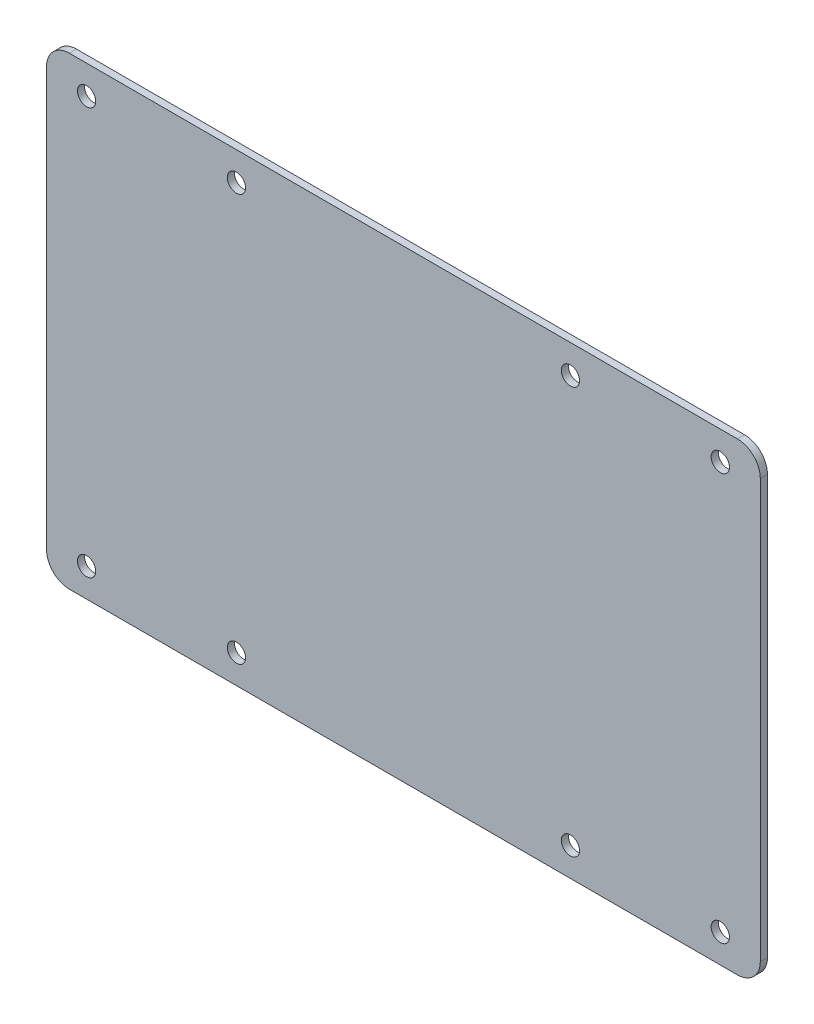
ISO-10303-21;
HEADER;
FILE_DESCRIPTION(('STEP AP214'),'2;1');
FILE_NAME('part.step','',(''),(''),'','','');
FILE_SCHEMA(('AUTOMOTIVE_DESIGN { 1 0 10303 214 1 1 1 1 }'));
ENDSEC;
DATA;
#1=APPLICATION_CONTEXT('core data for automotive mechanical design processes');
#2=APPLICATION_PROTOCOL_DEFINITION('international standard','automotive_design',2000,#1);
#3=PRODUCT_CONTEXT('',#1,'mechanical');
#4=PRODUCT('Part','Part','',(#3));
#5=PRODUCT_RELATED_PRODUCT_CATEGORY('part','',(#4));
#6=PRODUCT_DEFINITION_FORMATION('','',#4);
#7=PRODUCT_DEFINITION_CONTEXT('part definition',#1,'design');
#8=PRODUCT_DEFINITION('design','',#6,#7);
#9=PRODUCT_DEFINITION_SHAPE('','',#8);
#10=(LENGTH_UNIT() NAMED_UNIT(*) SI_UNIT(.MILLI.,.METRE.));
#11=(NAMED_UNIT(*) PLANE_ANGLE_UNIT() SI_UNIT($,.RADIAN.));
#12=(NAMED_UNIT(*) SI_UNIT($,.STERADIAN.) SOLID_ANGLE_UNIT());
#13=UNCERTAINTY_MEASURE_WITH_UNIT(LENGTH_MEASURE(1.E-05),#10,'distance_accuracy_value','');
#14=(GEOMETRIC_REPRESENTATION_CONTEXT(3) GLOBAL_UNCERTAINTY_ASSIGNED_CONTEXT((#13)) GLOBAL_UNIT_ASSIGNED_CONTEXT((#10,
#11,#12)) REPRESENTATION_CONTEXT('',''));
#15=CARTESIAN_POINT('',(0.,0.,0.));
#16=DIRECTION('',(0.,0.,1.));
#17=DIRECTION('',(1.,0.,0.));
#18=AXIS2_PLACEMENT_3D('',#15,#16,#17);
#19=CARTESIAN_POINT('',(3.81,78.97,1.5875));
#20=DIRECTION('',(0.,0.,-1.));
#21=DIRECTION('',(-1.,0.,0.));
#22=AXIS2_PLACEMENT_3D('',#19,#20,#21);
#23=PLANE('',#22);
#24=CARTESIAN_POINT('',(40.905,77.7,1.5875));
#25=DIRECTION('',(0.,0.,1.));
#26=DIRECTION('',(1.,0.,0.));
#27=AXIS2_PLACEMENT_3D('',#24,#25,#26);
#28=CIRCLE('',#27,2.03200000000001);
#29=CARTESIAN_POINT('',(42.937,77.7,1.5875));
#30=VERTEX_POINT('',#29);
#31=EDGE_CURVE('E212',#30,#30,#28,.T.);
#32=ORIENTED_EDGE('',*,*,#31,.F.);
#33=EDGE_LOOP('',(#32));
#34=FACE_BOUND('',#33,.T.);
#35=CARTESIAN_POINT('',(148.38,77.7,1.5875));
#36=DIRECTION('',(0.,0.,1.));
#37=DIRECTION('',(1.,0.,0.));
#38=AXIS2_PLACEMENT_3D('',#35,#36,#37);
#39=CIRCLE('',#38,2.03200000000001);
#40=CARTESIAN_POINT('',(150.412,77.7,1.5875));
#41=VERTEX_POINT('',#40);
#42=EDGE_CURVE('E200',#41,#41,#39,.T.);
#43=ORIENTED_EDGE('',*,*,#42,.F.);
#44=EDGE_LOOP('',(#43));
#45=FACE_BOUND('',#44,.T.);
#46=CARTESIAN_POINT('',(115.095,-12.7,1.5875));
#47=DIRECTION('',(0.,0.,1.));
#48=DIRECTION('',(1.,0.,0.));
#49=AXIS2_PLACEMENT_3D('',#46,#47,#48);
#50=CIRCLE('',#49,2.03200000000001);
#51=CARTESIAN_POINT('',(117.127,-12.7,1.5875));
#52=VERTEX_POINT('',#51);
#53=EDGE_CURVE('E188',#52,#52,#50,.T.);
#54=ORIENTED_EDGE('',*,*,#53,.F.);
#55=EDGE_LOOP('',(#54));
#56=FACE_BOUND('',#55,.T.);
#57=CARTESIAN_POINT('',(40.905,-12.7,1.5875));
#58=DIRECTION('',(0.,0.,1.));
#59=DIRECTION('',(1.,0.,0.));
#60=AXIS2_PLACEMENT_3D('',#57,#58,#59);
#61=CIRCLE('',#60,2.03200000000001);
#62=CARTESIAN_POINT('',(42.937,-12.7,1.5875));
#63=VERTEX_POINT('',#62);
#64=EDGE_CURVE('E134',#63,#63,#61,.T.);
#65=ORIENTED_EDGE('',*,*,#64,.F.);
#66=EDGE_LOOP('',(#65));
#67=FACE_BOUND('',#66,.T.);
#68=CARTESIAN_POINT('',(3.81,78.97,1.5875));
#69=DIRECTION('',(0.,0.,1.));
#70=DIRECTION('',(-1.,0.,0.));
#71=AXIS2_PLACEMENT_3D('',#68,#69,#70);
#72=CIRCLE('',#71,5.08);
#73=CARTESIAN_POINT('',(3.80999999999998,84.05,1.5875));
#74=VERTEX_POINT('',#73);
#75=CARTESIAN_POINT('',(-1.27,78.97,1.5875));
#76=VERTEX_POINT('',#75);
#77=EDGE_CURVE('E145',#74,#76,#72,.T.);
#78=ORIENTED_EDGE('',*,*,#77,.T.);
#79=DIRECTION('',(0.,-1.,0.));
#80=VECTOR('',#79,1.);
#81=CARTESIAN_POINT('',(-1.27,78.97,1.5875));
#82=LINE('',#81,#80);
#83=CARTESIAN_POINT('',(-1.27,-13.97,1.5875));
#84=VERTEX_POINT('',#83);
#85=EDGE_CURVE('E93',#76,#84,#82,.T.);
#86=ORIENTED_EDGE('',*,*,#85,.T.);
#87=CARTESIAN_POINT('',(3.81000000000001,-13.97,1.5875));
#88=DIRECTION('',(0.,0.,1.));
#89=DIRECTION('',(1.,0.,0.));
#90=AXIS2_PLACEMENT_3D('',#87,#88,#89);
#91=CIRCLE('',#90,5.08000000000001);
#92=CARTESIAN_POINT('',(3.81,-19.05,1.5875));
#93=VERTEX_POINT('',#92);
#94=EDGE_CURVE('E160',#84,#93,#91,.T.);
#95=ORIENTED_EDGE('',*,*,#94,.T.);
#96=DIRECTION('',(1.,0.,0.));
#97=VECTOR('',#96,1.);
#98=CARTESIAN_POINT('',(3.81,-19.05,1.5875));
#99=LINE('',#98,#97);
#100=CARTESIAN_POINT('',(152.19,-19.05,1.5875));
#101=VERTEX_POINT('',#100);
#102=EDGE_CURVE('E173',#93,#101,#99,.T.);
#103=ORIENTED_EDGE('',*,*,#102,.T.);
#104=CARTESIAN_POINT('',(152.19,-13.97,1.5875));
#105=DIRECTION('',(0.,0.,1.));
#106=DIRECTION('',(-1.,0.,0.));
#107=AXIS2_PLACEMENT_3D('',#104,#105,#106);
#108=CIRCLE('',#107,5.08);
#109=CARTESIAN_POINT('',(157.27,-13.97,1.5875));
#110=VERTEX_POINT('',#109);
#111=EDGE_CURVE('E112',#101,#110,#108,.T.);
#112=ORIENTED_EDGE('',*,*,#111,.T.);
#113=DIRECTION('',(0.,1.,0.));
#114=VECTOR('',#113,1.);
#115=CARTESIAN_POINT('',(157.27,-13.97,1.5875));
#116=LINE('',#115,#114);
#117=CARTESIAN_POINT('',(157.27,78.97,1.5875));
#118=VERTEX_POINT('',#117);
#119=EDGE_CURVE('E106',#110,#118,#116,.T.);
#120=ORIENTED_EDGE('',*,*,#119,.T.);
#121=CARTESIAN_POINT('',(152.19,78.97,1.5875));
#122=DIRECTION('',(0.,0.,1.));
#123=DIRECTION('',(-1.,0.,0.));
#124=AXIS2_PLACEMENT_3D('',#121,#122,#123);
#125=CIRCLE('',#124,5.08);
#126=CARTESIAN_POINT('',(152.19,84.05,1.5875));
#127=VERTEX_POINT('',#126);
#128=EDGE_CURVE('E110',#118,#127,#125,.T.);
#129=ORIENTED_EDGE('',*,*,#128,.T.);
#130=DIRECTION('',(-1.,0.,0.));
#131=VECTOR('',#130,1.);
#132=CARTESIAN_POINT('',(3.80999999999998,84.05,1.5875));
#133=LINE('',#132,#131);
#134=EDGE_CURVE('E50',#127,#74,#133,.T.);
#135=ORIENTED_EDGE('',*,*,#134,.T.);
#136=EDGE_LOOP('',(#78,#86,#95,#103,#112,#120,#129,#135));
#137=FACE_BOUND('',#136,.T.);
#138=CARTESIAN_POINT('',(7.62,-12.7,1.5875));
#139=DIRECTION('',(0.,0.,1.));
#140=DIRECTION('',(1.,0.,0.));
#141=AXIS2_PLACEMENT_3D('',#138,#139,#140);
#142=CIRCLE('',#141,2.03200000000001);
#143=CARTESIAN_POINT('',(9.652,-12.7,1.5875));
#144=VERTEX_POINT('',#143);
#145=EDGE_CURVE('E182',#144,#144,#142,.T.);
#146=ORIENTED_EDGE('',*,*,#145,.F.);
#147=EDGE_LOOP('',(#146));
#148=FACE_BOUND('',#147,.T.);
#149=CARTESIAN_POINT('',(148.38,-12.7,1.5875));
#150=DIRECTION('',(0.,0.,1.));
#151=DIRECTION('',(1.,0.,0.));
#152=AXIS2_PLACEMENT_3D('',#149,#150,#151);
#153=CIRCLE('',#152,2.03200000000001);
#154=CARTESIAN_POINT('',(150.412,-12.7,1.5875));
#155=VERTEX_POINT('',#154);
#156=EDGE_CURVE('E194',#155,#155,#153,.T.);
#157=ORIENTED_EDGE('',*,*,#156,.F.);
#158=EDGE_LOOP('',(#157));
#159=FACE_BOUND('',#158,.T.);
#160=CARTESIAN_POINT('',(115.095,77.7,1.5875));
#161=DIRECTION('',(0.,0.,1.));
#162=DIRECTION('',(1.,0.,0.));
#163=AXIS2_PLACEMENT_3D('',#160,#161,#162);
#164=CIRCLE('',#163,2.03200000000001);
#165=CARTESIAN_POINT('',(117.127,77.7,1.5875));
#166=VERTEX_POINT('',#165);
#167=EDGE_CURVE('E206',#166,#166,#164,.T.);
#168=ORIENTED_EDGE('',*,*,#167,.F.);
#169=EDGE_LOOP('',(#168));
#170=FACE_BOUND('',#169,.T.);
#171=CARTESIAN_POINT('',(7.62,77.7,1.5875));
#172=DIRECTION('',(0.,0.,1.));
#173=DIRECTION('',(1.,0.,0.));
#174=AXIS2_PLACEMENT_3D('',#171,#172,#173);
#175=CIRCLE('',#174,2.03200000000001);
#176=CARTESIAN_POINT('',(9.652,77.7,1.5875));
#177=VERTEX_POINT('',#176);
#178=EDGE_CURVE('E218',#177,#177,#175,.T.);
#179=ORIENTED_EDGE('',*,*,#178,.F.);
#180=EDGE_LOOP('',(#179));
#181=FACE_BOUND('',#180,.T.);
#182=ADVANCED_FACE('F33',(#34,#45,#56,#67,#137,#148,#159,#170,#181),#23,.F.);
#183=CARTESIAN_POINT('',(3.81,78.97,0.));
#184=DIRECTION('',(0.,0.,-1.));
#185=DIRECTION('',(-1.,0.,0.));
#186=AXIS2_PLACEMENT_3D('',#183,#184,#185);
#187=PLANE('',#186);
#188=CARTESIAN_POINT('',(40.905,77.7,0.));
#189=DIRECTION('',(0.,0.,1.));
#190=DIRECTION('',(1.,0.,0.));
#191=AXIS2_PLACEMENT_3D('',#188,#189,#190);
#192=CIRCLE('',#191,2.03200000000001);
#193=CARTESIAN_POINT('',(42.937,77.7,0.));
#194=VERTEX_POINT('',#193);
#195=EDGE_CURVE('E215',#194,#194,#192,.T.);
#196=ORIENTED_EDGE('',*,*,#195,.T.);
#197=EDGE_LOOP('',(#196));
#198=FACE_BOUND('',#197,.T.);
#199=CARTESIAN_POINT('',(148.38,77.7,0.));
#200=DIRECTION('',(0.,0.,1.));
#201=DIRECTION('',(1.,0.,0.));
#202=AXIS2_PLACEMENT_3D('',#199,#200,#201);
#203=CIRCLE('',#202,2.03200000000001);
#204=CARTESIAN_POINT('',(150.412,77.7,0.));
#205=VERTEX_POINT('',#204);
#206=EDGE_CURVE('E203',#205,#205,#203,.T.);
#207=ORIENTED_EDGE('',*,*,#206,.T.);
#208=EDGE_LOOP('',(#207));
#209=FACE_BOUND('',#208,.T.);
#210=CARTESIAN_POINT('',(115.095,-12.7,0.));
#211=DIRECTION('',(0.,0.,1.));
#212=DIRECTION('',(1.,0.,0.));
#213=AXIS2_PLACEMENT_3D('',#210,#211,#212);
#214=CIRCLE('',#213,2.03200000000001);
#215=CARTESIAN_POINT('',(117.127,-12.7,0.));
#216=VERTEX_POINT('',#215);
#217=EDGE_CURVE('E191',#216,#216,#214,.T.);
#218=ORIENTED_EDGE('',*,*,#217,.T.);
#219=EDGE_LOOP('',(#218));
#220=FACE_BOUND('',#219,.T.);
#221=CARTESIAN_POINT('',(40.905,-12.7,0.));
#222=DIRECTION('',(0.,0.,1.));
#223=DIRECTION('',(1.,0.,0.));
#224=AXIS2_PLACEMENT_3D('',#221,#222,#223);
#225=CIRCLE('',#224,2.03200000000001);
#226=CARTESIAN_POINT('',(42.937,-12.7,0.));
#227=VERTEX_POINT('',#226);
#228=EDGE_CURVE('E179',#227,#227,#225,.T.);
#229=ORIENTED_EDGE('',*,*,#228,.T.);
#230=EDGE_LOOP('',(#229));
#231=FACE_BOUND('',#230,.T.);
#232=CARTESIAN_POINT('',(3.81,78.97,0.));
#233=DIRECTION('',(0.,0.,1.));
#234=DIRECTION('',(-1.,0.,0.));
#235=AXIS2_PLACEMENT_3D('',#232,#233,#234);
#236=CIRCLE('',#235,5.08);
#237=CARTESIAN_POINT('',(3.80999999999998,84.05,0.));
#238=VERTEX_POINT('',#237);
#239=CARTESIAN_POINT('',(-1.27,78.97,0.));
#240=VERTEX_POINT('',#239);
#241=EDGE_CURVE('E130',#238,#240,#236,.T.);
#242=ORIENTED_EDGE('',*,*,#241,.F.);
#243=DIRECTION('',(-1.,0.,0.));
#244=VECTOR('',#243,1.);
#245=CARTESIAN_POINT('',(3.80999999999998,84.05,0.));
#246=LINE('',#245,#244);
#247=CARTESIAN_POINT('',(152.19,84.05,0.));
#248=VERTEX_POINT('',#247);
#249=EDGE_CURVE('E85',#248,#238,#246,.T.);
#250=ORIENTED_EDGE('',*,*,#249,.F.);
#251=CARTESIAN_POINT('',(152.19,78.97,0.));
#252=DIRECTION('',(0.,0.,1.));
#253=DIRECTION('',(-1.,0.,0.));
#254=AXIS2_PLACEMENT_3D('',#251,#252,#253);
#255=CIRCLE('',#254,5.08);
#256=CARTESIAN_POINT('',(157.27,78.97,0.));
#257=VERTEX_POINT('',#256);
#258=EDGE_CURVE('E79',#257,#248,#255,.T.);
#259=ORIENTED_EDGE('',*,*,#258,.F.);
#260=DIRECTION('',(0.,1.,0.));
#261=VECTOR('',#260,1.);
#262=CARTESIAN_POINT('',(157.27,-13.97,0.));
#263=LINE('',#262,#261);
#264=CARTESIAN_POINT('',(157.27,-13.97,0.));
#265=VERTEX_POINT('',#264);
#266=EDGE_CURVE('E120',#265,#257,#263,.T.);
#267=ORIENTED_EDGE('',*,*,#266,.F.);
#268=CARTESIAN_POINT('',(152.19,-13.97,0.));
#269=DIRECTION('',(0.,0.,1.));
#270=DIRECTION('',(-1.,0.,0.));
#271=AXIS2_PLACEMENT_3D('',#268,#269,#270);
#272=CIRCLE('',#271,5.08);
#273=CARTESIAN_POINT('',(152.19,-19.05,0.));
#274=VERTEX_POINT('',#273);
#275=EDGE_CURVE('E140',#274,#265,#272,.T.);
#276=ORIENTED_EDGE('',*,*,#275,.F.);
#277=DIRECTION('',(1.,0.,0.));
#278=VECTOR('',#277,1.);
#279=CARTESIAN_POINT('',(3.81,-19.05,0.));
#280=LINE('',#279,#278);
#281=CARTESIAN_POINT('',(3.81,-19.05,0.));
#282=VERTEX_POINT('',#281);
#283=EDGE_CURVE('E138',#282,#274,#280,.T.);
#284=ORIENTED_EDGE('',*,*,#283,.F.);
#285=CARTESIAN_POINT('',(3.81000000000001,-13.97,0.));
#286=DIRECTION('',(0.,0.,1.));
#287=DIRECTION('',(1.,0.,0.));
#288=AXIS2_PLACEMENT_3D('',#285,#286,#287);
#289=CIRCLE('',#288,5.08000000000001);
#290=CARTESIAN_POINT('',(-1.27,-13.97,0.));
#291=VERTEX_POINT('',#290);
#292=EDGE_CURVE('E136',#291,#282,#289,.T.);
#293=ORIENTED_EDGE('',*,*,#292,.F.);
#294=DIRECTION('',(0.,-1.,0.));
#295=VECTOR('',#294,1.);
#296=CARTESIAN_POINT('',(-1.27,78.97,0.));
#297=LINE('',#296,#295);
#298=EDGE_CURVE('E133',#240,#291,#297,.T.);
#299=ORIENTED_EDGE('',*,*,#298,.F.);
#300=EDGE_LOOP('',(#242,#250,#259,#267,#276,#284,#293,#299));
#301=FACE_BOUND('',#300,.T.);
#302=CARTESIAN_POINT('',(7.62,-12.7,0.));
#303=DIRECTION('',(0.,0.,1.));
#304=DIRECTION('',(1.,0.,0.));
#305=AXIS2_PLACEMENT_3D('',#302,#303,#304);
#306=CIRCLE('',#305,2.03200000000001);
#307=CARTESIAN_POINT('',(9.652,-12.7,0.));
#308=VERTEX_POINT('',#307);
#309=EDGE_CURVE('E185',#308,#308,#306,.T.);
#310=ORIENTED_EDGE('',*,*,#309,.T.);
#311=EDGE_LOOP('',(#310));
#312=FACE_BOUND('',#311,.T.);
#313=CARTESIAN_POINT('',(148.38,-12.7,0.));
#314=DIRECTION('',(0.,0.,1.));
#315=DIRECTION('',(1.,0.,0.));
#316=AXIS2_PLACEMENT_3D('',#313,#314,#315);
#317=CIRCLE('',#316,2.03200000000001);
#318=CARTESIAN_POINT('',(150.412,-12.7,0.));
#319=VERTEX_POINT('',#318);
#320=EDGE_CURVE('E197',#319,#319,#317,.T.);
#321=ORIENTED_EDGE('',*,*,#320,.T.);
#322=EDGE_LOOP('',(#321));
#323=FACE_BOUND('',#322,.T.);
#324=CARTESIAN_POINT('',(115.095,77.7,0.));
#325=DIRECTION('',(0.,0.,1.));
#326=DIRECTION('',(1.,0.,0.));
#327=AXIS2_PLACEMENT_3D('',#324,#325,#326);
#328=CIRCLE('',#327,2.03200000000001);
#329=CARTESIAN_POINT('',(117.127,77.7,0.));
#330=VERTEX_POINT('',#329);
#331=EDGE_CURVE('E209',#330,#330,#328,.T.);
#332=ORIENTED_EDGE('',*,*,#331,.T.);
#333=EDGE_LOOP('',(#332));
#334=FACE_BOUND('',#333,.T.);
#335=CARTESIAN_POINT('',(7.62,77.7,0.));
#336=DIRECTION('',(0.,0.,1.));
#337=DIRECTION('',(1.,0.,0.));
#338=AXIS2_PLACEMENT_3D('',#335,#336,#337);
#339=CIRCLE('',#338,2.03200000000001);
#340=CARTESIAN_POINT('',(9.652,77.7,0.));
#341=VERTEX_POINT('',#340);
#342=EDGE_CURVE('E221',#341,#341,#339,.T.);
#343=ORIENTED_EDGE('',*,*,#342,.T.);
#344=EDGE_LOOP('',(#343));
#345=FACE_BOUND('',#344,.T.);
#346=ADVANCED_FACE('F164',(#198,#209,#220,#231,#301,#312,#323,#334,#345),#187,.T.);
#347=CARTESIAN_POINT('',(3.81,78.97,1.5875));
#348=DIRECTION('',(0.,0.,-1.));
#349=DIRECTION('',(-1.,0.,0.));
#350=AXIS2_PLACEMENT_3D('',#347,#348,#349);
#351=CYLINDRICAL_SURFACE('',#350,5.08);
#352=ORIENTED_EDGE('',*,*,#241,.T.);
#353=DIRECTION('',(0.,0.,-1.));
#354=VECTOR('',#353,1.);
#355=CARTESIAN_POINT('',(-1.27,78.97,1.5875));
#356=LINE('',#355,#354);
#357=EDGE_CURVE('E11',#76,#240,#356,.T.);
#358=ORIENTED_EDGE('',*,*,#357,.F.);
#359=ORIENTED_EDGE('',*,*,#77,.F.);
#360=DIRECTION('',(0.,0.,-1.));
#361=VECTOR('',#360,1.);
#362=CARTESIAN_POINT('',(3.80999999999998,84.05,1.5875));
#363=LINE('',#362,#361);
#364=EDGE_CURVE('E126',#74,#238,#363,.T.);
#365=ORIENTED_EDGE('',*,*,#364,.T.);
#366=EDGE_LOOP('',(#352,#358,#359,#365));
#367=FACE_BOUND('',#366,.T.);
#368=ADVANCED_FACE('F35',(#367),#351,.T.);
#369=CARTESIAN_POINT('',(-1.27,78.97,1.5875));
#370=DIRECTION('',(1.,0.,0.));
#371=DIRECTION('',(0.,1.,0.));
#372=AXIS2_PLACEMENT_3D('',#369,#370,#371);
#373=PLANE('',#372);
#374=ORIENTED_EDGE('',*,*,#298,.T.);
#375=DIRECTION('',(0.,0.,-1.));
#376=VECTOR('',#375,1.);
#377=CARTESIAN_POINT('',(-1.27,-13.97,1.5875));
#378=LINE('',#377,#376);
#379=EDGE_CURVE('E42',#84,#291,#378,.T.);
#380=ORIENTED_EDGE('',*,*,#379,.F.);
#381=ORIENTED_EDGE('',*,*,#85,.F.);
#382=ORIENTED_EDGE('',*,*,#357,.T.);
#383=EDGE_LOOP('',(#374,#380,#381,#382));
#384=FACE_BOUND('',#383,.T.);
#385=ADVANCED_FACE('F256',(#384),#373,.F.);
#386=CARTESIAN_POINT('',(3.81000000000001,-13.97,1.5875));
#387=DIRECTION('',(0.,0.,-1.));
#388=DIRECTION('',(-1.,0.,0.));
#389=AXIS2_PLACEMENT_3D('',#386,#387,#388);
#390=CYLINDRICAL_SURFACE('',#389,5.08000000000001);
#391=ORIENTED_EDGE('',*,*,#292,.T.);
#392=DIRECTION('',(0.,0.,-1.));
#393=VECTOR('',#392,1.);
#394=CARTESIAN_POINT('',(3.81,-19.05,1.5875));
#395=LINE('',#394,#393);
#396=EDGE_CURVE('E152',#93,#282,#395,.T.);
#397=ORIENTED_EDGE('',*,*,#396,.F.);
#398=ORIENTED_EDGE('',*,*,#94,.F.);
#399=ORIENTED_EDGE('',*,*,#379,.T.);
#400=EDGE_LOOP('',(#391,#397,#398,#399));
#401=FACE_BOUND('',#400,.T.);
#402=ADVANCED_FACE('F158',(#401),#390,.T.);
#403=CARTESIAN_POINT('',(3.81,-19.05,1.5875));
#404=DIRECTION('',(0.,1.,0.));
#405=DIRECTION('',(0.,0.,1.));
#406=AXIS2_PLACEMENT_3D('',#403,#404,#405);
#407=PLANE('',#406);
#408=ORIENTED_EDGE('',*,*,#283,.T.);
#409=DIRECTION('',(0.,0.,-1.));
#410=VECTOR('',#409,1.);
#411=CARTESIAN_POINT('',(152.19,-19.05,1.5875));
#412=LINE('',#411,#410);
#413=EDGE_CURVE('E149',#101,#274,#412,.T.);
#414=ORIENTED_EDGE('',*,*,#413,.F.);
#415=ORIENTED_EDGE('',*,*,#102,.F.);
#416=ORIENTED_EDGE('',*,*,#396,.T.);
#417=EDGE_LOOP('',(#408,#414,#415,#416));
#418=FACE_BOUND('',#417,.T.);
#419=ADVANCED_FACE('F169',(#418),#407,.F.);
#420=CARTESIAN_POINT('',(152.19,-13.97,1.5875));
#421=DIRECTION('',(0.,0.,-1.));
#422=DIRECTION('',(-1.,0.,0.));
#423=AXIS2_PLACEMENT_3D('',#420,#421,#422);
#424=CYLINDRICAL_SURFACE('',#423,5.08);
#425=ORIENTED_EDGE('',*,*,#275,.T.);
#426=DIRECTION('',(0.,0.,-1.));
#427=VECTOR('',#426,1.);
#428=CARTESIAN_POINT('',(157.27,-13.97,1.5875));
#429=LINE('',#428,#427);
#430=EDGE_CURVE('E121',#110,#265,#429,.T.);
#431=ORIENTED_EDGE('',*,*,#430,.F.);
#432=ORIENTED_EDGE('',*,*,#111,.F.);
#433=ORIENTED_EDGE('',*,*,#413,.T.);
#434=EDGE_LOOP('',(#425,#431,#432,#433));
#435=FACE_BOUND('',#434,.T.);
#436=ADVANCED_FACE('F172',(#435),#424,.T.);
#437=CARTESIAN_POINT('',(157.27,-13.97,1.5875));
#438=DIRECTION('',(-1.,0.,0.));
#439=DIRECTION('',(0.,0.,1.));
#440=AXIS2_PLACEMENT_3D('',#437,#438,#439);
#441=PLANE('',#440);
#442=ORIENTED_EDGE('',*,*,#266,.T.);
#443=DIRECTION('',(0.,0.,-1.));
#444=VECTOR('',#443,1.);
#445=CARTESIAN_POINT('',(157.27,78.97,1.5875));
#446=LINE('',#445,#444);
#447=EDGE_CURVE('E117',#118,#257,#446,.T.);
#448=ORIENTED_EDGE('',*,*,#447,.F.);
#449=ORIENTED_EDGE('',*,*,#119,.F.);
#450=ORIENTED_EDGE('',*,*,#430,.T.);
#451=EDGE_LOOP('',(#442,#448,#449,#450));
#452=FACE_BOUND('',#451,.T.);
#453=ADVANCED_FACE('F118',(#452),#441,.F.);
#454=CARTESIAN_POINT('',(152.19,78.97,1.5875));
#455=DIRECTION('',(0.,0.,-1.));
#456=DIRECTION('',(-1.,0.,0.));
#457=AXIS2_PLACEMENT_3D('',#454,#455,#456);
#458=CYLINDRICAL_SURFACE('',#457,5.08);
#459=ORIENTED_EDGE('',*,*,#258,.T.);
#460=DIRECTION('',(0.,0.,-1.));
#461=VECTOR('',#460,1.);
#462=CARTESIAN_POINT('',(152.19,84.05,1.5875));
#463=LINE('',#462,#461);
#464=EDGE_CURVE('E122',#127,#248,#463,.T.);
#465=ORIENTED_EDGE('',*,*,#464,.F.);
#466=ORIENTED_EDGE('',*,*,#128,.F.);
#467=ORIENTED_EDGE('',*,*,#447,.T.);
#468=EDGE_LOOP('',(#459,#465,#466,#467));
#469=FACE_BOUND('',#468,.T.);
#470=ADVANCED_FACE('F124',(#469),#458,.T.);
#471=CARTESIAN_POINT('',(3.80999999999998,84.05,1.5875));
#472=DIRECTION('',(0.,-1.,0.));
#473=DIRECTION('',(0.,0.,-1.));
#474=AXIS2_PLACEMENT_3D('',#471,#472,#473);
#475=PLANE('',#474);
#476=ORIENTED_EDGE('',*,*,#249,.T.);
#477=ORIENTED_EDGE('',*,*,#364,.F.);
#478=ORIENTED_EDGE('',*,*,#134,.F.);
#479=ORIENTED_EDGE('',*,*,#464,.T.);
#480=EDGE_LOOP('',(#476,#477,#478,#479));
#481=FACE_BOUND('',#480,.T.);
#482=ADVANCED_FACE('F244',(#481),#475,.F.);
#483=CARTESIAN_POINT('',(40.905,-12.7,1.5875));
#484=DIRECTION('',(0.,0.,-1.));
#485=DIRECTION('',(-1.,0.,0.));
#486=AXIS2_PLACEMENT_3D('',#483,#484,#485);
#487=CYLINDRICAL_SURFACE('',#486,2.03200000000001);
#488=ORIENTED_EDGE('',*,*,#64,.T.);
#489=EDGE_LOOP('',(#488));
#490=FACE_BOUND('',#489,.T.);
#491=ORIENTED_EDGE('',*,*,#228,.F.);
#492=EDGE_LOOP('',(#491));
#493=FACE_BOUND('',#492,.T.);
#494=ADVANCED_FACE('F241',(#490,#493),#487,.F.);
#495=CARTESIAN_POINT('',(7.62,-12.7,1.5875));
#496=DIRECTION('',(0.,0.,-1.));
#497=DIRECTION('',(-1.,0.,0.));
#498=AXIS2_PLACEMENT_3D('',#495,#496,#497);
#499=CYLINDRICAL_SURFACE('',#498,2.03200000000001);
#500=ORIENTED_EDGE('',*,*,#145,.T.);
#501=EDGE_LOOP('',(#500));
#502=FACE_BOUND('',#501,.T.);
#503=ORIENTED_EDGE('',*,*,#309,.F.);
#504=EDGE_LOOP('',(#503));
#505=FACE_BOUND('',#504,.T.);
#506=ADVANCED_FACE('F320',(#502,#505),#499,.F.);
#507=CARTESIAN_POINT('',(115.095,-12.7,1.5875));
#508=DIRECTION('',(0.,0.,-1.));
#509=DIRECTION('',(-1.,0.,0.));
#510=AXIS2_PLACEMENT_3D('',#507,#508,#509);
#511=CYLINDRICAL_SURFACE('',#510,2.03200000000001);
#512=ORIENTED_EDGE('',*,*,#53,.T.);
#513=EDGE_LOOP('',(#512));
#514=FACE_BOUND('',#513,.T.);
#515=ORIENTED_EDGE('',*,*,#217,.F.);
#516=EDGE_LOOP('',(#515));
#517=FACE_BOUND('',#516,.T.);
#518=ADVANCED_FACE('F328',(#514,#517),#511,.F.);
#519=CARTESIAN_POINT('',(148.38,-12.7,1.5875));
#520=DIRECTION('',(0.,0.,-1.));
#521=DIRECTION('',(-1.,0.,0.));
#522=AXIS2_PLACEMENT_3D('',#519,#520,#521);
#523=CYLINDRICAL_SURFACE('',#522,2.03200000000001);
#524=ORIENTED_EDGE('',*,*,#156,.T.);
#525=EDGE_LOOP('',(#524));
#526=FACE_BOUND('',#525,.T.);
#527=ORIENTED_EDGE('',*,*,#320,.F.);
#528=EDGE_LOOP('',(#527));
#529=FACE_BOUND('',#528,.T.);
#530=ADVANCED_FACE('F336',(#526,#529),#523,.F.);
#531=CARTESIAN_POINT('',(148.38,77.7,1.5875));
#532=DIRECTION('',(0.,0.,-1.));
#533=DIRECTION('',(-1.,0.,0.));
#534=AXIS2_PLACEMENT_3D('',#531,#532,#533);
#535=CYLINDRICAL_SURFACE('',#534,2.03200000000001);
#536=ORIENTED_EDGE('',*,*,#42,.T.);
#537=EDGE_LOOP('',(#536));
#538=FACE_BOUND('',#537,.T.);
#539=ORIENTED_EDGE('',*,*,#206,.F.);
#540=EDGE_LOOP('',(#539));
#541=FACE_BOUND('',#540,.T.);
#542=ADVANCED_FACE('F345',(#538,#541),#535,.F.);
#543=CARTESIAN_POINT('',(115.095,77.7,1.5875));
#544=DIRECTION('',(0.,0.,-1.));
#545=DIRECTION('',(-1.,0.,0.));
#546=AXIS2_PLACEMENT_3D('',#543,#544,#545);
#547=CYLINDRICAL_SURFACE('',#546,2.03200000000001);
#548=ORIENTED_EDGE('',*,*,#167,.T.);
#549=EDGE_LOOP('',(#548));
#550=FACE_BOUND('',#549,.T.);
#551=ORIENTED_EDGE('',*,*,#331,.F.);
#552=EDGE_LOOP('',(#551));
#553=FACE_BOUND('',#552,.T.);
#554=ADVANCED_FACE('F354',(#550,#553),#547,.F.);
#555=CARTESIAN_POINT('',(40.905,77.7,1.5875));
#556=DIRECTION('',(0.,0.,-1.));
#557=DIRECTION('',(-1.,0.,0.));
#558=AXIS2_PLACEMENT_3D('',#555,#556,#557);
#559=CYLINDRICAL_SURFACE('',#558,2.03200000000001);
#560=ORIENTED_EDGE('',*,*,#31,.T.);
#561=EDGE_LOOP('',(#560));
#562=FACE_BOUND('',#561,.T.);
#563=ORIENTED_EDGE('',*,*,#195,.F.);
#564=EDGE_LOOP('',(#563));
#565=FACE_BOUND('',#564,.T.);
#566=ADVANCED_FACE('F363',(#562,#565),#559,.F.);
#567=CARTESIAN_POINT('',(7.62,77.7,1.5875));
#568=DIRECTION('',(0.,0.,-1.));
#569=DIRECTION('',(-1.,0.,0.));
#570=AXIS2_PLACEMENT_3D('',#567,#568,#569);
#571=CYLINDRICAL_SURFACE('',#570,2.03200000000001);
#572=ORIENTED_EDGE('',*,*,#178,.T.);
#573=EDGE_LOOP('',(#572));
#574=FACE_BOUND('',#573,.T.);
#575=ORIENTED_EDGE('',*,*,#342,.F.);
#576=EDGE_LOOP('',(#575));
#577=FACE_BOUND('',#576,.T.);
#578=ADVANCED_FACE('F227',(#574,#577),#571,.F.);
#579=CLOSED_SHELL('',(#182,#346,#368,#385,#402,#419,#436,#453,#470,#482,#494,#506,#518,#530,
#542,#554,#566,#578));
#580=MANIFOLD_SOLID_BREP('B2',#579);
#581=ADVANCED_BREP_SHAPE_REPRESENTATION('',(#18,#580),#14);
#582=SHAPE_DEFINITION_REPRESENTATION(#9,#581);
ENDSEC;
END-ISO-10303-21;
